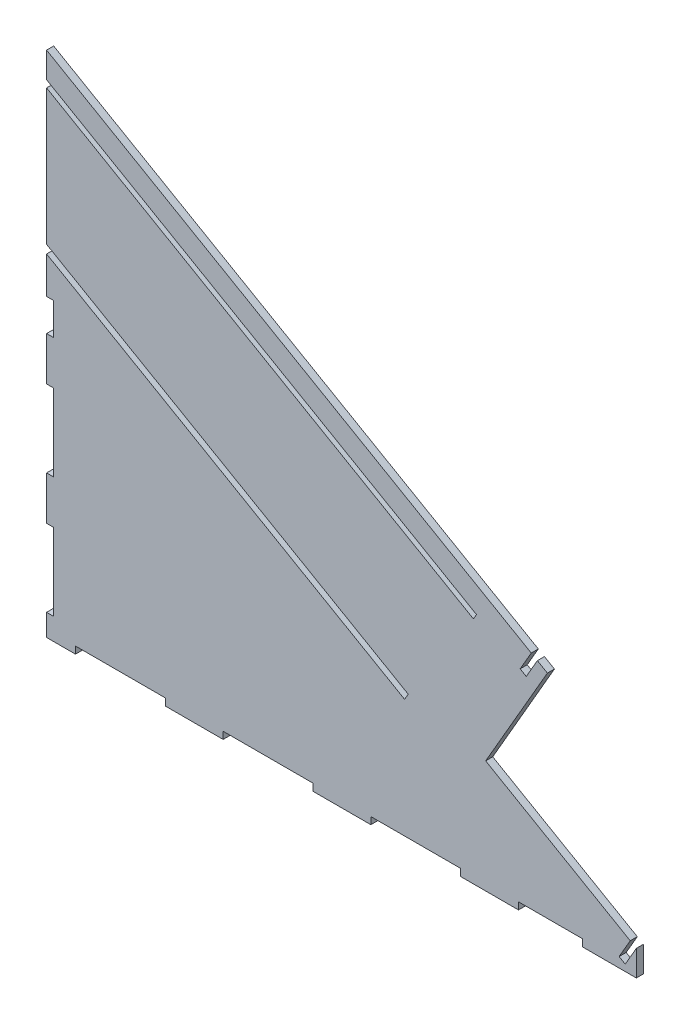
from build123d import *

# Parameters (mm, degrees)
BOSS_EXTRUDE1_DEPTH = 5.5


with BuildPart() as part:
    # Sketch1 → Boss-Extrude1 (new body)
    with BuildSketch(Plane.XY):
        Polygon((0, 447), (0, 467), (377.442668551, 249.079976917), (368.782347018, 234.080093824), (373.545468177, 231.330061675), (382.20578971, 246.329944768), (390, 241.829885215), (341.935215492, 158.580534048), (390, 130.829885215), (454.518641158, 93.57944974), (445.858319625, 78.579566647), (450.621440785, 75.829534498), (459.281762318, 90.829417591), (459.281762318, 70.829417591), (437.5, 70.829417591), (417.5, 70.829417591), (417.5, 76.329417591), (367.5, 76.329417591), (367.5, 70.829417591), (322.5, 70.829417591), (322.5, 76.329417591), (252.5, 76.329417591), (252.5, 70.829417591), (207.5, 70.829417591), (207.5, 76.329417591), (137.5, 76.329417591), (137.5, 70.829417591), (92.5, 70.829417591), (92.5, 76.329417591), (22.5, 76.329417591), (22.5, 70.829417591), (0, 70.829417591), (0, 87.829417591), (5.5, 87.829417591), (5.5, 147.829417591), (0, 147.829417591), (0, 181.829417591), (5.5, 181.829417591), (5.5, 241.829417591), (0, 241.829417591), (0, 275.829417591), (5.5, 275.829417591), (5.5, 300.829417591), (0, 300.829417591), (0, 329.5), (278.804080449, 168.529880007), (281.618684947, 173.404842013), (276.743722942, 176.219446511), (0, 336), (0, 361.5), (0, 421.5), (0, 441.5), (332.413383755, 249.578051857), (334.794972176, 253.703019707), (332.413383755, 255.078051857), align=None)
    extrude(amount=BOSS_EXTRUDE1_DEPTH)


solid = part.part
